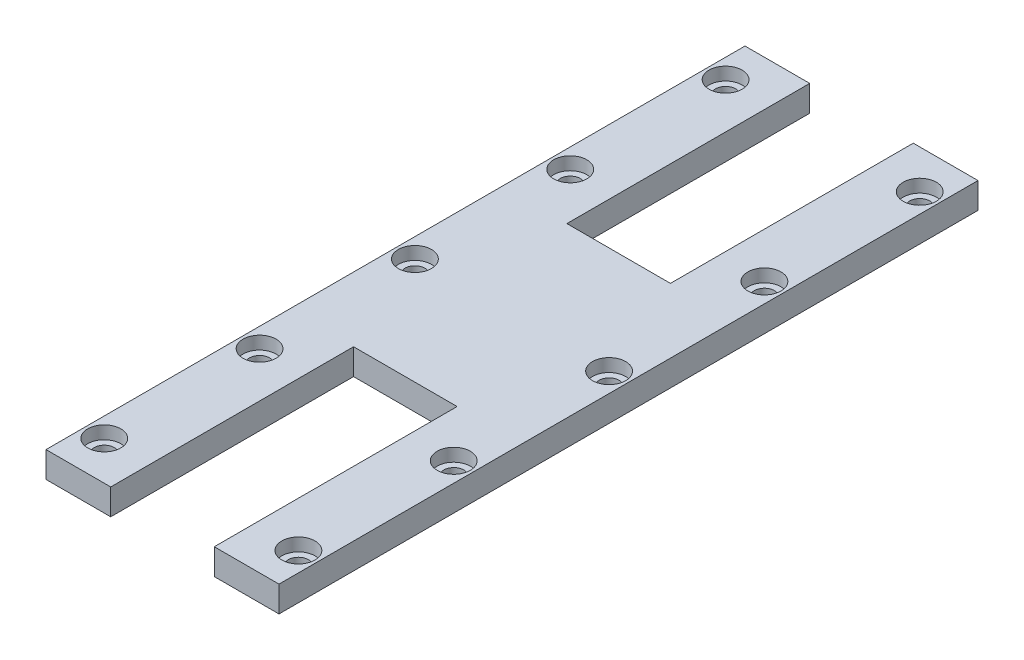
ISO-10303-21;
HEADER;
FILE_DESCRIPTION(('STEP AP214'),'2;1');
FILE_NAME('part.step','',(''),(''),'','','');
FILE_SCHEMA(('AUTOMOTIVE_DESIGN { 1 0 10303 214 1 1 1 1 }'));
ENDSEC;
DATA;
#1=APPLICATION_CONTEXT('core data for automotive mechanical design processes');
#2=APPLICATION_PROTOCOL_DEFINITION('international standard','automotive_design',2000,#1);
#3=PRODUCT_CONTEXT('',#1,'mechanical');
#4=PRODUCT('Part','Part','',(#3));
#5=PRODUCT_RELATED_PRODUCT_CATEGORY('part','',(#4));
#6=PRODUCT_DEFINITION_FORMATION('','',#4);
#7=PRODUCT_DEFINITION_CONTEXT('part definition',#1,'design');
#8=PRODUCT_DEFINITION('design','',#6,#7);
#9=PRODUCT_DEFINITION_SHAPE('','',#8);
#10=(LENGTH_UNIT() NAMED_UNIT(*) SI_UNIT(.MILLI.,.METRE.));
#11=(NAMED_UNIT(*) PLANE_ANGLE_UNIT() SI_UNIT($,.RADIAN.));
#12=(NAMED_UNIT(*) SI_UNIT($,.STERADIAN.) SOLID_ANGLE_UNIT());
#13=UNCERTAINTY_MEASURE_WITH_UNIT(LENGTH_MEASURE(1.E-05),#10,'distance_accuracy_value','');
#14=(GEOMETRIC_REPRESENTATION_CONTEXT(3) GLOBAL_UNCERTAINTY_ASSIGNED_CONTEXT((#13)) GLOBAL_UNIT_ASSIGNED_CONTEXT((#10,
#11,#12)) REPRESENTATION_CONTEXT('',''));
#15=CARTESIAN_POINT('',(0.,0.,0.));
#16=DIRECTION('',(0.,0.,1.));
#17=DIRECTION('',(1.,0.,0.));
#18=AXIS2_PLACEMENT_3D('',#15,#16,#17);
#19=CARTESIAN_POINT('',(52.3875,0.,-123.825));
#20=DIRECTION('',(0.,1.,0.));
#21=DIRECTION('',(0.,0.,1.));
#22=AXIS2_PLACEMENT_3D('',#19,#20,#21);
#23=CYLINDRICAL_SURFACE('',#22,2.45745);
#24=CARTESIAN_POINT('',(52.3875,0.,-123.825));
#25=DIRECTION('',(0.,1.,0.));
#26=DIRECTION('',(0.,0.,1.));
#27=AXIS2_PLACEMENT_3D('',#24,#25,#26);
#28=CIRCLE('',#27,2.45745);
#29=CARTESIAN_POINT('',(52.3875,0.,-121.36755));
#30=VERTEX_POINT('',#29);
#31=EDGE_CURVE('E229',#30,#30,#28,.T.);
#32=ORIENTED_EDGE('',*,*,#31,.F.);
#33=EDGE_LOOP('',(#32));
#34=FACE_BOUND('',#33,.T.);
#35=CARTESIAN_POINT('',(52.3875,3.175,-123.825));
#36=DIRECTION('',(0.,1.,0.));
#37=DIRECTION('',(0.,0.,1.));
#38=AXIS2_PLACEMENT_3D('',#35,#36,#37);
#39=CIRCLE('',#38,2.45745);
#40=CARTESIAN_POINT('',(52.3875,3.175,-121.36755));
#41=VERTEX_POINT('',#40);
#42=EDGE_CURVE('E37',#41,#41,#39,.F.);
#43=ORIENTED_EDGE('',*,*,#42,.F.);
#44=EDGE_LOOP('',(#43));
#45=FACE_BOUND('',#44,.T.);
#46=ADVANCED_FACE('F33',(#34,#45),#23,.F.);
#47=CARTESIAN_POINT('',(4.7625,0.,-47.625));
#48=DIRECTION('',(0.,1.,0.));
#49=DIRECTION('',(0.,0.,1.));
#50=AXIS2_PLACEMENT_3D('',#47,#48,#49);
#51=CYLINDRICAL_SURFACE('',#50,2.45745);
#52=CARTESIAN_POINT('',(4.7625,0.,-47.625));
#53=DIRECTION('',(0.,1.,0.));
#54=DIRECTION('',(0.,0.,1.));
#55=AXIS2_PLACEMENT_3D('',#52,#53,#54);
#56=CIRCLE('',#55,2.45745);
#57=CARTESIAN_POINT('',(4.7625,0.,-45.16755));
#58=VERTEX_POINT('',#57);
#59=EDGE_CURVE('E232',#58,#58,#56,.T.);
#60=ORIENTED_EDGE('',*,*,#59,.F.);
#61=EDGE_LOOP('',(#60));
#62=FACE_BOUND('',#61,.T.);
#63=CARTESIAN_POINT('',(4.7625,3.175,-47.625));
#64=DIRECTION('',(0.,1.,0.));
#65=DIRECTION('',(0.,0.,1.));
#66=AXIS2_PLACEMENT_3D('',#63,#64,#65);
#67=CIRCLE('',#66,2.45745);
#68=CARTESIAN_POINT('',(4.7625,3.175,-45.16755));
#69=VERTEX_POINT('',#68);
#70=EDGE_CURVE('E201',#69,#69,#67,.F.);
#71=ORIENTED_EDGE('',*,*,#70,.F.);
#72=EDGE_LOOP('',(#71));
#73=FACE_BOUND('',#72,.T.);
#74=ADVANCED_FACE('F315',(#62,#73),#51,.F.);
#75=CARTESIAN_POINT('',(4.7625,0.,-85.725));
#76=DIRECTION('',(0.,1.,0.));
#77=DIRECTION('',(0.,0.,1.));
#78=AXIS2_PLACEMENT_3D('',#75,#76,#77);
#79=CYLINDRICAL_SURFACE('',#78,2.45745);
#80=CARTESIAN_POINT('',(4.7625,0.,-85.725));
#81=DIRECTION('',(0.,1.,0.));
#82=DIRECTION('',(0.,0.,1.));
#83=AXIS2_PLACEMENT_3D('',#80,#81,#82);
#84=CIRCLE('',#83,2.45745);
#85=CARTESIAN_POINT('',(4.7625,0.,-83.26755));
#86=VERTEX_POINT('',#85);
#87=EDGE_CURVE('E235',#86,#86,#84,.T.);
#88=ORIENTED_EDGE('',*,*,#87,.F.);
#89=EDGE_LOOP('',(#88));
#90=FACE_BOUND('',#89,.T.);
#91=CARTESIAN_POINT('',(4.7625,3.175,-85.725));
#92=DIRECTION('',(0.,1.,0.));
#93=DIRECTION('',(0.,0.,1.));
#94=AXIS2_PLACEMENT_3D('',#91,#92,#93);
#95=CIRCLE('',#94,2.45745);
#96=CARTESIAN_POINT('',(4.7625,3.175,-83.26755));
#97=VERTEX_POINT('',#96);
#98=EDGE_CURVE('E199',#97,#97,#95,.F.);
#99=ORIENTED_EDGE('',*,*,#98,.F.);
#100=EDGE_LOOP('',(#99));
#101=FACE_BOUND('',#100,.T.);
#102=ADVANCED_FACE('F321',(#90,#101),#79,.F.);
#103=CARTESIAN_POINT('',(4.7625,0.,-123.825));
#104=DIRECTION('',(0.,1.,0.));
#105=DIRECTION('',(0.,0.,1.));
#106=AXIS2_PLACEMENT_3D('',#103,#104,#105);
#107=CYLINDRICAL_SURFACE('',#106,2.45745);
#108=CARTESIAN_POINT('',(4.7625,0.,-123.825));
#109=DIRECTION('',(0.,1.,0.));
#110=DIRECTION('',(0.,0.,1.));
#111=AXIS2_PLACEMENT_3D('',#108,#109,#110);
#112=CIRCLE('',#111,2.45745);
#113=CARTESIAN_POINT('',(4.7625,0.,-121.36755));
#114=VERTEX_POINT('',#113);
#115=EDGE_CURVE('E238',#114,#114,#112,.T.);
#116=ORIENTED_EDGE('',*,*,#115,.F.);
#117=EDGE_LOOP('',(#116));
#118=FACE_BOUND('',#117,.T.);
#119=CARTESIAN_POINT('',(4.7625,3.175,-123.825));
#120=DIRECTION('',(0.,1.,0.));
#121=DIRECTION('',(0.,0.,1.));
#122=AXIS2_PLACEMENT_3D('',#119,#120,#121);
#123=CIRCLE('',#122,2.45745);
#124=CARTESIAN_POINT('',(4.7625,3.175,-121.36755));
#125=VERTEX_POINT('',#124);
#126=EDGE_CURVE('E196',#125,#125,#123,.F.);
#127=ORIENTED_EDGE('',*,*,#126,.F.);
#128=EDGE_LOOP('',(#127));
#129=FACE_BOUND('',#128,.T.);
#130=ADVANCED_FACE('F328',(#118,#129),#107,.F.);
#131=CARTESIAN_POINT('',(52.3875,0.,-9.52499999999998));
#132=DIRECTION('',(0.,1.,0.));
#133=DIRECTION('',(0.,0.,1.));
#134=AXIS2_PLACEMENT_3D('',#131,#132,#133);
#135=CYLINDRICAL_SURFACE('',#134,2.45745);
#136=CARTESIAN_POINT('',(52.3875,0.,-9.52499999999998));
#137=DIRECTION('',(0.,1.,0.));
#138=DIRECTION('',(0.,0.,1.));
#139=AXIS2_PLACEMENT_3D('',#136,#137,#138);
#140=CIRCLE('',#139,2.45745);
#141=CARTESIAN_POINT('',(52.3875,0.,-7.06754999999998));
#142=VERTEX_POINT('',#141);
#143=EDGE_CURVE('E220',#142,#142,#140,.T.);
#144=ORIENTED_EDGE('',*,*,#143,.F.);
#145=EDGE_LOOP('',(#144));
#146=FACE_BOUND('',#145,.T.);
#147=CARTESIAN_POINT('',(52.3875,3.175,-9.52499999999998));
#148=DIRECTION('',(0.,1.,0.));
#149=DIRECTION('',(0.,0.,1.));
#150=AXIS2_PLACEMENT_3D('',#147,#148,#149);
#151=CIRCLE('',#150,2.45745);
#152=CARTESIAN_POINT('',(52.3875,3.175,-7.06754999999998));
#153=VERTEX_POINT('',#152);
#154=EDGE_CURVE('E193',#153,#153,#151,.F.);
#155=ORIENTED_EDGE('',*,*,#154,.F.);
#156=EDGE_LOOP('',(#155));
#157=FACE_BOUND('',#156,.T.);
#158=ADVANCED_FACE('F331',(#146,#157),#135,.F.);
#159=CARTESIAN_POINT('',(4.7625,0.,-9.52499999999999));
#160=DIRECTION('',(0.,1.,0.));
#161=DIRECTION('',(0.,0.,1.));
#162=AXIS2_PLACEMENT_3D('',#159,#160,#161);
#163=CYLINDRICAL_SURFACE('',#162,2.45745);
#164=CARTESIAN_POINT('',(4.7625,0.,-9.52499999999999));
#165=DIRECTION('',(0.,1.,0.));
#166=DIRECTION('',(0.,0.,1.));
#167=AXIS2_PLACEMENT_3D('',#164,#165,#166);
#168=CIRCLE('',#167,2.45745);
#169=CARTESIAN_POINT('',(4.7625,0.,-7.06754999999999));
#170=VERTEX_POINT('',#169);
#171=EDGE_CURVE('E217',#170,#170,#168,.T.);
#172=ORIENTED_EDGE('',*,*,#171,.F.);
#173=EDGE_LOOP('',(#172));
#174=FACE_BOUND('',#173,.T.);
#175=CARTESIAN_POINT('',(4.7625,3.175,-9.52499999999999));
#176=DIRECTION('',(0.,1.,0.));
#177=DIRECTION('',(0.,0.,1.));
#178=AXIS2_PLACEMENT_3D('',#175,#176,#177);
#179=CIRCLE('',#178,2.45745);
#180=CARTESIAN_POINT('',(4.7625,3.175,-7.06754999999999));
#181=VERTEX_POINT('',#180);
#182=EDGE_CURVE('E190',#181,#181,#179,.F.);
#183=ORIENTED_EDGE('',*,*,#182,.F.);
#184=EDGE_LOOP('',(#183));
#185=FACE_BOUND('',#184,.T.);
#186=ADVANCED_FACE('F366',(#174,#185),#163,.F.);
#187=CARTESIAN_POINT('',(52.3875,0.,-161.925));
#188=DIRECTION('',(0.,1.,0.));
#189=DIRECTION('',(0.,0.,1.));
#190=AXIS2_PLACEMENT_3D('',#187,#188,#189);
#191=CYLINDRICAL_SURFACE('',#190,2.45745);
#192=CARTESIAN_POINT('',(52.3875,0.,-161.925));
#193=DIRECTION('',(0.,1.,0.));
#194=DIRECTION('',(0.,0.,1.));
#195=AXIS2_PLACEMENT_3D('',#192,#193,#194);
#196=CIRCLE('',#195,2.45745);
#197=CARTESIAN_POINT('',(52.3875,0.,-159.46755));
#198=VERTEX_POINT('',#197);
#199=EDGE_CURVE('E178',#198,#198,#196,.T.);
#200=ORIENTED_EDGE('',*,*,#199,.F.);
#201=EDGE_LOOP('',(#200));
#202=FACE_BOUND('',#201,.T.);
#203=CARTESIAN_POINT('',(52.3875,3.175,-161.925));
#204=DIRECTION('',(0.,1.,0.));
#205=DIRECTION('',(0.,0.,1.));
#206=AXIS2_PLACEMENT_3D('',#203,#204,#205);
#207=CIRCLE('',#206,2.45745);
#208=CARTESIAN_POINT('',(52.3875,3.175,-159.46755));
#209=VERTEX_POINT('',#208);
#210=EDGE_CURVE('E187',#209,#209,#207,.F.);
#211=ORIENTED_EDGE('',*,*,#210,.F.);
#212=EDGE_LOOP('',(#211));
#213=FACE_BOUND('',#212,.T.);
#214=ADVANCED_FACE('F369',(#202,#213),#191,.F.);
#215=CARTESIAN_POINT('',(52.3875,0.,-47.625));
#216=DIRECTION('',(0.,1.,0.));
#217=DIRECTION('',(0.,0.,1.));
#218=AXIS2_PLACEMENT_3D('',#215,#216,#217);
#219=CYLINDRICAL_SURFACE('',#218,2.45745);
#220=CARTESIAN_POINT('',(52.3875,0.,-47.625));
#221=DIRECTION('',(0.,1.,0.));
#222=DIRECTION('',(0.,0.,1.));
#223=AXIS2_PLACEMENT_3D('',#220,#221,#222);
#224=CIRCLE('',#223,2.45745);
#225=CARTESIAN_POINT('',(52.3875,0.,-45.16755));
#226=VERTEX_POINT('',#225);
#227=EDGE_CURVE('E225',#226,#226,#224,.T.);
#228=ORIENTED_EDGE('',*,*,#227,.F.);
#229=EDGE_LOOP('',(#228));
#230=FACE_BOUND('',#229,.T.);
#231=CARTESIAN_POINT('',(52.3875,3.175,-47.625));
#232=DIRECTION('',(0.,1.,0.));
#233=DIRECTION('',(0.,0.,1.));
#234=AXIS2_PLACEMENT_3D('',#231,#232,#233);
#235=CIRCLE('',#234,2.45745);
#236=CARTESIAN_POINT('',(52.3875,3.175,-45.16755));
#237=VERTEX_POINT('',#236);
#238=EDGE_CURVE('E183',#237,#237,#235,.F.);
#239=ORIENTED_EDGE('',*,*,#238,.F.);
#240=EDGE_LOOP('',(#239));
#241=FACE_BOUND('',#240,.T.);
#242=ADVANCED_FACE('F345',(#230,#241),#219,.F.);
#243=CARTESIAN_POINT('',(52.3875,0.,-85.725));
#244=DIRECTION('',(0.,1.,0.));
#245=DIRECTION('',(0.,0.,1.));
#246=AXIS2_PLACEMENT_3D('',#243,#244,#245);
#247=CYLINDRICAL_SURFACE('',#246,2.45745);
#248=CARTESIAN_POINT('',(52.3875,0.,-85.725));
#249=DIRECTION('',(0.,1.,0.));
#250=DIRECTION('',(0.,0.,1.));
#251=AXIS2_PLACEMENT_3D('',#248,#249,#250);
#252=CIRCLE('',#251,2.45745);
#253=CARTESIAN_POINT('',(52.3875,0.,-83.26755));
#254=VERTEX_POINT('',#253);
#255=EDGE_CURVE('E226',#254,#254,#252,.T.);
#256=ORIENTED_EDGE('',*,*,#255,.F.);
#257=EDGE_LOOP('',(#256));
#258=FACE_BOUND('',#257,.T.);
#259=CARTESIAN_POINT('',(52.3875,3.175,-85.725));
#260=DIRECTION('',(0.,1.,0.));
#261=DIRECTION('',(0.,0.,1.));
#262=AXIS2_PLACEMENT_3D('',#259,#260,#261);
#263=CIRCLE('',#262,2.45745);
#264=CARTESIAN_POINT('',(52.3875,3.175,-83.26755));
#265=VERTEX_POINT('',#264);
#266=EDGE_CURVE('E180',#265,#265,#263,.F.);
#267=ORIENTED_EDGE('',*,*,#266,.F.);
#268=EDGE_LOOP('',(#267));
#269=FACE_BOUND('',#268,.T.);
#270=ADVANCED_FACE('F337',(#258,#269),#247,.F.);
#271=CARTESIAN_POINT('',(4.7625,0.,-161.925));
#272=DIRECTION('',(0.,1.,0.));
#273=DIRECTION('',(0.,0.,1.));
#274=AXIS2_PLACEMENT_3D('',#271,#272,#273);
#275=CYLINDRICAL_SURFACE('',#274,2.45745);
#276=CARTESIAN_POINT('',(4.7625,0.,-161.925));
#277=DIRECTION('',(0.,1.,0.));
#278=DIRECTION('',(0.,0.,1.));
#279=AXIS2_PLACEMENT_3D('',#276,#277,#278);
#280=CIRCLE('',#279,2.45745);
#281=CARTESIAN_POINT('',(4.7625,0.,-159.46755));
#282=VERTEX_POINT('',#281);
#283=EDGE_CURVE('E134',#282,#282,#280,.T.);
#284=ORIENTED_EDGE('',*,*,#283,.F.);
#285=EDGE_LOOP('',(#284));
#286=FACE_BOUND('',#285,.T.);
#287=CARTESIAN_POINT('',(4.7625,3.175,-161.925));
#288=DIRECTION('',(0.,1.,0.));
#289=DIRECTION('',(0.,0.,1.));
#290=AXIS2_PLACEMENT_3D('',#287,#288,#289);
#291=CIRCLE('',#290,2.45745);
#292=CARTESIAN_POINT('',(4.7625,3.175,-159.46755));
#293=VERTEX_POINT('',#292);
#294=EDGE_CURVE('E175',#293,#293,#291,.F.);
#295=ORIENTED_EDGE('',*,*,#294,.F.);
#296=EDGE_LOOP('',(#295));
#297=FACE_BOUND('',#296,.T.);
#298=ADVANCED_FACE('F335',(#286,#297),#275,.F.);
#299=CARTESIAN_POINT('',(0.,0.,0.));
#300=DIRECTION('',(0.,0.,-1.));
#301=DIRECTION('',(-1.,0.,0.));
#302=AXIS2_PLACEMENT_3D('',#299,#300,#301);
#303=PLANE('',#302);
#304=DIRECTION('',(1.,0.,0.));
#305=VECTOR('',#304,1.);
#306=CARTESIAN_POINT('',(0.,0.,0.));
#307=LINE('',#306,#305);
#308=CARTESIAN_POINT('',(0.,0.,0.));
#309=VERTEX_POINT('',#308);
#310=CARTESIAN_POINT('',(15.875,0.,0.));
#311=VERTEX_POINT('',#310);
#312=EDGE_CURVE('E143',#309,#311,#307,.T.);
#313=ORIENTED_EDGE('',*,*,#312,.T.);
#314=DIRECTION('',(0.,1.,0.));
#315=VECTOR('',#314,1.);
#316=CARTESIAN_POINT('',(15.875,0.,0.));
#317=LINE('',#316,#315);
#318=CARTESIAN_POINT('',(15.875,6.35,0.));
#319=VERTEX_POINT('',#318);
#320=EDGE_CURVE('E42',#311,#319,#317,.T.);
#321=ORIENTED_EDGE('',*,*,#320,.T.);
#322=DIRECTION('',(-1.,0.,0.));
#323=VECTOR('',#322,1.);
#324=CARTESIAN_POINT('',(0.,6.35,0.));
#325=LINE('',#324,#323);
#326=CARTESIAN_POINT('',(0.,6.35,0.));
#327=VERTEX_POINT('',#326);
#328=EDGE_CURVE('E140',#319,#327,#325,.T.);
#329=ORIENTED_EDGE('',*,*,#328,.T.);
#330=DIRECTION('',(0.,-1.,0.));
#331=VECTOR('',#330,1.);
#332=CARTESIAN_POINT('',(0.,0.,0.));
#333=LINE('',#332,#331);
#334=EDGE_CURVE('E270',#327,#309,#333,.T.);
#335=ORIENTED_EDGE('',*,*,#334,.T.);
#336=EDGE_LOOP('',(#313,#321,#329,#335));
#337=FACE_BOUND('',#336,.T.);
#338=ADVANCED_FACE('F138',(#337),#303,.F.);
#339=CARTESIAN_POINT('',(0.,0.,-171.45));
#340=DIRECTION('',(0.,0.,-1.));
#341=DIRECTION('',(-1.,0.,0.));
#342=AXIS2_PLACEMENT_3D('',#339,#340,#341);
#343=PLANE('',#342);
#344=DIRECTION('',(0.,1.,0.));
#345=VECTOR('',#344,1.);
#346=CARTESIAN_POINT('',(15.875,0.,-171.45));
#347=LINE('',#346,#345);
#348=CARTESIAN_POINT('',(15.875,0.,-171.45));
#349=VERTEX_POINT('',#348);
#350=CARTESIAN_POINT('',(15.875,6.35,-171.45));
#351=VERTEX_POINT('',#350);
#352=EDGE_CURVE('E170',#349,#351,#347,.T.);
#353=ORIENTED_EDGE('',*,*,#352,.F.);
#354=DIRECTION('',(1.,0.,0.));
#355=VECTOR('',#354,1.);
#356=CARTESIAN_POINT('',(0.,0.,-171.45));
#357=LINE('',#356,#355);
#358=CARTESIAN_POINT('',(0.,0.,-171.45));
#359=VERTEX_POINT('',#358);
#360=EDGE_CURVE('E274',#359,#349,#357,.T.);
#361=ORIENTED_EDGE('',*,*,#360,.F.);
#362=DIRECTION('',(0.,-1.,0.));
#363=VECTOR('',#362,1.);
#364=CARTESIAN_POINT('',(0.,0.,-171.45));
#365=LINE('',#364,#363);
#366=CARTESIAN_POINT('',(0.,6.35,-171.45));
#367=VERTEX_POINT('',#366);
#368=EDGE_CURVE('E154',#367,#359,#365,.T.);
#369=ORIENTED_EDGE('',*,*,#368,.F.);
#370=DIRECTION('',(-1.,0.,0.));
#371=VECTOR('',#370,1.);
#372=CARTESIAN_POINT('',(0.,6.35,-171.45));
#373=LINE('',#372,#371);
#374=EDGE_CURVE('E280',#351,#367,#373,.T.);
#375=ORIENTED_EDGE('',*,*,#374,.F.);
#376=EDGE_LOOP('',(#353,#361,#369,#375));
#377=FACE_BOUND('',#376,.T.);
#378=ADVANCED_FACE('F343',(#377),#343,.T.);
#379=CARTESIAN_POINT('',(0.,0.,-171.45));
#380=DIRECTION('',(-1.,0.,0.));
#381=DIRECTION('',(0.,0.,1.));
#382=AXIS2_PLACEMENT_3D('',#379,#380,#381);
#383=PLANE('',#382);
#384=ORIENTED_EDGE('',*,*,#334,.F.);
#385=DIRECTION('',(0.,0.,1.));
#386=VECTOR('',#385,1.);
#387=CARTESIAN_POINT('',(0.,6.35,-171.45));
#388=LINE('',#387,#386);
#389=EDGE_CURVE('E148',#367,#327,#388,.T.);
#390=ORIENTED_EDGE('',*,*,#389,.F.);
#391=ORIENTED_EDGE('',*,*,#368,.T.);
#392=DIRECTION('',(0.,0.,1.));
#393=VECTOR('',#392,1.);
#394=CARTESIAN_POINT('',(0.,0.,-171.45));
#395=LINE('',#394,#393);
#396=EDGE_CURVE('E166',#359,#309,#395,.T.);
#397=ORIENTED_EDGE('',*,*,#396,.T.);
#398=EDGE_LOOP('',(#384,#390,#391,#397));
#399=FACE_BOUND('',#398,.T.);
#400=ADVANCED_FACE('F35',(#399),#383,.T.);
#401=CARTESIAN_POINT('',(0.,6.35,-171.45));
#402=DIRECTION('',(0.,1.,0.));
#403=DIRECTION('',(0.,0.,1.));
#404=AXIS2_PLACEMENT_3D('',#401,#402,#403);
#405=PLANE('',#404);
#406=CARTESIAN_POINT('',(52.3875,6.35,-47.625));
#407=DIRECTION('',(0.,1.,0.));
#408=DIRECTION('',(0.,0.,1.));
#409=AXIS2_PLACEMENT_3D('',#406,#407,#408);
#410=CIRCLE('',#409,4.064);
#411=CARTESIAN_POINT('',(52.3875,6.35,-43.561));
#412=VERTEX_POINT('',#411);
#413=EDGE_CURVE('E478',#412,#412,#410,.T.);
#414=ORIENTED_EDGE('',*,*,#413,.F.);
#415=EDGE_LOOP('',(#414));
#416=FACE_BOUND('',#415,.T.);
#417=CARTESIAN_POINT('',(52.3875,6.35,-85.725));
#418=DIRECTION('',(0.,1.,0.));
#419=DIRECTION('',(0.,0.,1.));
#420=AXIS2_PLACEMENT_3D('',#417,#418,#419);
#421=CIRCLE('',#420,4.064);
#422=CARTESIAN_POINT('',(52.3875,6.35,-81.661));
#423=VERTEX_POINT('',#422);
#424=EDGE_CURVE('E471',#423,#423,#421,.T.);
#425=ORIENTED_EDGE('',*,*,#424,.F.);
#426=EDGE_LOOP('',(#425));
#427=FACE_BOUND('',#426,.T.);
#428=CARTESIAN_POINT('',(4.7625,6.35,-9.52499999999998));
#429=DIRECTION('',(0.,1.,0.));
#430=DIRECTION('',(0.,0.,1.));
#431=AXIS2_PLACEMENT_3D('',#428,#429,#430);
#432=CIRCLE('',#431,4.064);
#433=CARTESIAN_POINT('',(4.7625,6.35,-5.46099999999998));
#434=VERTEX_POINT('',#433);
#435=EDGE_CURVE('E488',#434,#434,#432,.T.);
#436=ORIENTED_EDGE('',*,*,#435,.F.);
#437=EDGE_LOOP('',(#436));
#438=FACE_BOUND('',#437,.T.);
#439=CARTESIAN_POINT('',(52.3875,6.35,-161.925));
#440=DIRECTION('',(0.,1.,0.));
#441=DIRECTION('',(0.,0.,1.));
#442=AXIS2_PLACEMENT_3D('',#439,#440,#441);
#443=CIRCLE('',#442,4.064);
#444=CARTESIAN_POINT('',(52.3875,6.35,-157.861));
#445=VERTEX_POINT('',#444);
#446=EDGE_CURVE('E494',#445,#445,#443,.T.);
#447=ORIENTED_EDGE('',*,*,#446,.F.);
#448=EDGE_LOOP('',(#447));
#449=FACE_BOUND('',#448,.T.);
#450=CARTESIAN_POINT('',(52.3875,6.35,-123.825));
#451=DIRECTION('',(0.,1.,0.));
#452=DIRECTION('',(0.,0.,1.));
#453=AXIS2_PLACEMENT_3D('',#450,#451,#452);
#454=CIRCLE('',#453,4.064);
#455=CARTESIAN_POINT('',(52.3875,6.35,-119.761));
#456=VERTEX_POINT('',#455);
#457=EDGE_CURVE('E482',#456,#456,#454,.T.);
#458=ORIENTED_EDGE('',*,*,#457,.F.);
#459=EDGE_LOOP('',(#458));
#460=FACE_BOUND('',#459,.T.);
#461=CARTESIAN_POINT('',(52.3875,6.35,-9.52499999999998));
#462=DIRECTION('',(0.,1.,0.));
#463=DIRECTION('',(0.,0.,1.));
#464=AXIS2_PLACEMENT_3D('',#461,#462,#463);
#465=CIRCLE('',#464,4.064);
#466=CARTESIAN_POINT('',(52.3875,6.35,-5.46099999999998));
#467=VERTEX_POINT('',#466);
#468=EDGE_CURVE('E450',#467,#467,#465,.T.);
#469=ORIENTED_EDGE('',*,*,#468,.F.);
#470=EDGE_LOOP('',(#469));
#471=FACE_BOUND('',#470,.T.);
#472=CARTESIAN_POINT('',(4.7625,6.35,-47.625));
#473=DIRECTION('',(0.,1.,0.));
#474=DIRECTION('',(0.,0.,1.));
#475=AXIS2_PLACEMENT_3D('',#472,#473,#474);
#476=CIRCLE('',#475,4.064);
#477=CARTESIAN_POINT('',(4.7625,6.35,-43.561));
#478=VERTEX_POINT('',#477);
#479=EDGE_CURVE('E449',#478,#478,#476,.T.);
#480=ORIENTED_EDGE('',*,*,#479,.F.);
#481=EDGE_LOOP('',(#480));
#482=FACE_BOUND('',#481,.T.);
#483=CARTESIAN_POINT('',(4.7625,6.35,-85.725));
#484=DIRECTION('',(0.,1.,0.));
#485=DIRECTION('',(0.,0.,1.));
#486=AXIS2_PLACEMENT_3D('',#483,#484,#485);
#487=CIRCLE('',#486,4.064);
#488=CARTESIAN_POINT('',(4.7625,6.35,-81.661));
#489=VERTEX_POINT('',#488);
#490=EDGE_CURVE('E460',#489,#489,#487,.T.);
#491=ORIENTED_EDGE('',*,*,#490,.F.);
#492=EDGE_LOOP('',(#491));
#493=FACE_BOUND('',#492,.T.);
#494=CARTESIAN_POINT('',(4.7625,6.35,-123.825));
#495=DIRECTION('',(0.,1.,0.));
#496=DIRECTION('',(0.,0.,1.));
#497=AXIS2_PLACEMENT_3D('',#494,#495,#496);
#498=CIRCLE('',#497,4.064);
#499=CARTESIAN_POINT('',(4.7625,6.35,-119.761));
#500=VERTEX_POINT('',#499);
#501=EDGE_CURVE('E466',#500,#500,#498,.T.);
#502=ORIENTED_EDGE('',*,*,#501,.F.);
#503=EDGE_LOOP('',(#502));
#504=FACE_BOUND('',#503,.T.);
#505=CARTESIAN_POINT('',(4.7625,6.35,-161.925));
#506=DIRECTION('',(0.,1.,0.));
#507=DIRECTION('',(0.,0.,1.));
#508=AXIS2_PLACEMENT_3D('',#505,#506,#507);
#509=CIRCLE('',#508,4.064);
#510=CARTESIAN_POINT('',(4.7625,6.35,-157.861));
#511=VERTEX_POINT('',#510);
#512=EDGE_CURVE('E206',#511,#511,#509,.T.);
#513=ORIENTED_EDGE('',*,*,#512,.F.);
#514=EDGE_LOOP('',(#513));
#515=FACE_BOUND('',#514,.T.);
#516=DIRECTION('',(0.,0.,1.));
#517=VECTOR('',#516,1.);
#518=CARTESIAN_POINT('',(15.875,6.35,0.));
#519=LINE('',#518,#517);
#520=CARTESIAN_POINT('',(15.875,6.35,-59.563));
#521=VERTEX_POINT('',#520);
#522=EDGE_CURVE('E123',#521,#319,#519,.T.);
#523=ORIENTED_EDGE('',*,*,#522,.F.);
#524=DIRECTION('',(-1.,0.,0.));
#525=VECTOR('',#524,1.);
#526=CARTESIAN_POINT('',(15.875,6.35,-59.563));
#527=LINE('',#526,#525);
#528=CARTESIAN_POINT('',(41.275,6.35,-59.563));
#529=VERTEX_POINT('',#528);
#530=EDGE_CURVE('E247',#529,#521,#527,.T.);
#531=ORIENTED_EDGE('',*,*,#530,.F.);
#532=DIRECTION('',(0.,0.,-1.));
#533=VECTOR('',#532,1.);
#534=CARTESIAN_POINT('',(41.275,6.35,0.));
#535=LINE('',#534,#533);
#536=CARTESIAN_POINT('',(41.275,6.35,0.));
#537=VERTEX_POINT('',#536);
#538=EDGE_CURVE('E133',#537,#529,#535,.T.);
#539=ORIENTED_EDGE('',*,*,#538,.F.);
#540=CARTESIAN_POINT('',(57.15,6.35,0.));
#541=VERTEX_POINT('',#540);
#542=EDGE_CURVE('E150',#541,#537,#325,.T.);
#543=ORIENTED_EDGE('',*,*,#542,.F.);
#544=DIRECTION('',(0.,0.,1.));
#545=VECTOR('',#544,1.);
#546=CARTESIAN_POINT('',(57.15,6.35,-171.45));
#547=LINE('',#546,#545);
#548=CARTESIAN_POINT('',(57.15,6.35,-171.45));
#549=VERTEX_POINT('',#548);
#550=EDGE_CURVE('E161',#549,#541,#547,.T.);
#551=ORIENTED_EDGE('',*,*,#550,.F.);
#552=CARTESIAN_POINT('',(41.275,6.35,-171.45));
#553=VERTEX_POINT('',#552);
#554=EDGE_CURVE('E168',#549,#553,#373,.T.);
#555=ORIENTED_EDGE('',*,*,#554,.T.);
#556=DIRECTION('',(0.,0.,-1.));
#557=VECTOR('',#556,1.);
#558=CARTESIAN_POINT('',(41.275,6.35,-171.45));
#559=LINE('',#558,#557);
#560=CARTESIAN_POINT('',(41.275,6.35,-111.887));
#561=VERTEX_POINT('',#560);
#562=EDGE_CURVE('E58',#561,#553,#559,.T.);
#563=ORIENTED_EDGE('',*,*,#562,.F.);
#564=DIRECTION('',(1.,0.,0.));
#565=VECTOR('',#564,1.);
#566=CARTESIAN_POINT('',(15.875,6.35,-111.887));
#567=LINE('',#566,#565);
#568=CARTESIAN_POINT('',(15.875,6.35,-111.887));
#569=VERTEX_POINT('',#568);
#570=EDGE_CURVE('E258',#569,#561,#567,.T.);
#571=ORIENTED_EDGE('',*,*,#570,.F.);
#572=DIRECTION('',(0.,0.,1.));
#573=VECTOR('',#572,1.);
#574=CARTESIAN_POINT('',(15.875,6.35,-171.45));
#575=LINE('',#574,#573);
#576=EDGE_CURVE('E255',#351,#569,#575,.T.);
#577=ORIENTED_EDGE('',*,*,#576,.F.);
#578=ORIENTED_EDGE('',*,*,#374,.T.);
#579=ORIENTED_EDGE('',*,*,#389,.T.);
#580=ORIENTED_EDGE('',*,*,#328,.F.);
#581=EDGE_LOOP('',(#523,#531,#539,#543,#551,#555,#563,#571,#577,#578,#579,#580));
#582=FACE_BOUND('',#581,.T.);
#583=ADVANCED_FACE('F146',(#416,#427,#438,#449,#460,#471,#482,#493,#504,#515,#582),#405,.T.);
#584=CARTESIAN_POINT('',(57.15,0.,-171.45));
#585=DIRECTION('',(1.,0.,0.));
#586=DIRECTION('',(0.,0.,-1.));
#587=AXIS2_PLACEMENT_3D('',#584,#585,#586);
#588=PLANE('',#587);
#589=DIRECTION('',(0.,1.,0.));
#590=VECTOR('',#589,1.);
#591=CARTESIAN_POINT('',(57.15,0.,0.));
#592=LINE('',#591,#590);
#593=CARTESIAN_POINT('',(57.15,0.,0.));
#594=VERTEX_POINT('',#593);
#595=EDGE_CURVE('E151',#594,#541,#592,.T.);
#596=ORIENTED_EDGE('',*,*,#595,.F.);
#597=DIRECTION('',(0.,0.,1.));
#598=VECTOR('',#597,1.);
#599=CARTESIAN_POINT('',(57.15,0.,-171.45));
#600=LINE('',#599,#598);
#601=CARTESIAN_POINT('',(57.15,0.,-171.45));
#602=VERTEX_POINT('',#601);
#603=EDGE_CURVE('E163',#602,#594,#600,.T.);
#604=ORIENTED_EDGE('',*,*,#603,.F.);
#605=DIRECTION('',(0.,1.,0.));
#606=VECTOR('',#605,1.);
#607=CARTESIAN_POINT('',(57.15,0.,-171.45));
#608=LINE('',#607,#606);
#609=EDGE_CURVE('E277',#602,#549,#608,.T.);
#610=ORIENTED_EDGE('',*,*,#609,.T.);
#611=ORIENTED_EDGE('',*,*,#550,.T.);
#612=EDGE_LOOP('',(#596,#604,#610,#611));
#613=FACE_BOUND('',#612,.T.);
#614=ADVANCED_FACE('F296',(#613),#588,.T.);
#615=CARTESIAN_POINT('',(0.,0.,-171.45));
#616=DIRECTION('',(0.,-1.,0.));
#617=DIRECTION('',(0.,0.,-1.));
#618=AXIS2_PLACEMENT_3D('',#615,#616,#617);
#619=PLANE('',#618);
#620=ORIENTED_EDGE('',*,*,#255,.T.);
#621=EDGE_LOOP('',(#620));
#622=FACE_BOUND('',#621,.T.);
#623=ORIENTED_EDGE('',*,*,#227,.T.);
#624=EDGE_LOOP('',(#623));
#625=FACE_BOUND('',#624,.T.);
#626=ORIENTED_EDGE('',*,*,#199,.T.);
#627=EDGE_LOOP('',(#626));
#628=FACE_BOUND('',#627,.T.);
#629=ORIENTED_EDGE('',*,*,#171,.T.);
#630=EDGE_LOOP('',(#629));
#631=FACE_BOUND('',#630,.T.);
#632=ORIENTED_EDGE('',*,*,#143,.T.);
#633=EDGE_LOOP('',(#632));
#634=FACE_BOUND('',#633,.T.);
#635=ORIENTED_EDGE('',*,*,#115,.T.);
#636=EDGE_LOOP('',(#635));
#637=FACE_BOUND('',#636,.T.);
#638=ORIENTED_EDGE('',*,*,#87,.T.);
#639=EDGE_LOOP('',(#638));
#640=FACE_BOUND('',#639,.T.);
#641=ORIENTED_EDGE('',*,*,#59,.T.);
#642=EDGE_LOOP('',(#641));
#643=FACE_BOUND('',#642,.T.);
#644=ORIENTED_EDGE('',*,*,#31,.T.);
#645=EDGE_LOOP('',(#644));
#646=FACE_BOUND('',#645,.T.);
#647=ORIENTED_EDGE('',*,*,#283,.T.);
#648=EDGE_LOOP('',(#647));
#649=FACE_BOUND('',#648,.T.);
#650=DIRECTION('',(0.,0.,-1.));
#651=VECTOR('',#650,1.);
#652=CARTESIAN_POINT('',(15.875,0.,-171.45));
#653=LINE('',#652,#651);
#654=CARTESIAN_POINT('',(15.875,0.,-59.563));
#655=VERTEX_POINT('',#654);
#656=EDGE_CURVE('E253',#311,#655,#653,.T.);
#657=ORIENTED_EDGE('',*,*,#656,.F.);
#658=ORIENTED_EDGE('',*,*,#312,.F.);
#659=ORIENTED_EDGE('',*,*,#396,.F.);
#660=ORIENTED_EDGE('',*,*,#360,.T.);
#661=DIRECTION('',(0.,0.,-1.));
#662=VECTOR('',#661,1.);
#663=CARTESIAN_POINT('',(15.875,0.,-171.45));
#664=LINE('',#663,#662);
#665=CARTESIAN_POINT('',(15.875,0.,-111.887));
#666=VERTEX_POINT('',#665);
#667=EDGE_CURVE('E268',#666,#349,#664,.T.);
#668=ORIENTED_EDGE('',*,*,#667,.F.);
#669=DIRECTION('',(-1.,0.,0.));
#670=VECTOR('',#669,1.);
#671=CARTESIAN_POINT('',(0.,0.,-111.887));
#672=LINE('',#671,#670);
#673=CARTESIAN_POINT('',(41.275,0.,-111.887));
#674=VERTEX_POINT('',#673);
#675=EDGE_CURVE('E172',#674,#666,#672,.T.);
#676=ORIENTED_EDGE('',*,*,#675,.F.);
#677=DIRECTION('',(0.,0.,1.));
#678=VECTOR('',#677,1.);
#679=CARTESIAN_POINT('',(41.275,0.,-171.45));
#680=LINE('',#679,#678);
#681=CARTESIAN_POINT('',(41.275,0.,-171.45));
#682=VERTEX_POINT('',#681);
#683=EDGE_CURVE('E265',#682,#674,#680,.T.);
#684=ORIENTED_EDGE('',*,*,#683,.F.);
#685=EDGE_CURVE('E273',#682,#602,#357,.T.);
#686=ORIENTED_EDGE('',*,*,#685,.T.);
#687=ORIENTED_EDGE('',*,*,#603,.T.);
#688=CARTESIAN_POINT('',(41.275,0.,0.));
#689=VERTEX_POINT('',#688);
#690=EDGE_CURVE('E283',#689,#594,#307,.T.);
#691=ORIENTED_EDGE('',*,*,#690,.F.);
#692=DIRECTION('',(0.,0.,1.));
#693=VECTOR('',#692,1.);
#694=CARTESIAN_POINT('',(41.275,0.,-171.45));
#695=LINE('',#694,#693);
#696=CARTESIAN_POINT('',(41.275,0.,-59.563));
#697=VERTEX_POINT('',#696);
#698=EDGE_CURVE('E50',#697,#689,#695,.T.);
#699=ORIENTED_EDGE('',*,*,#698,.F.);
#700=DIRECTION('',(1.,0.,0.));
#701=VECTOR('',#700,1.);
#702=CARTESIAN_POINT('',(0.,0.,-59.563));
#703=LINE('',#702,#701);
#704=EDGE_CURVE('E11',#655,#697,#703,.T.);
#705=ORIENTED_EDGE('',*,*,#704,.F.);
#706=EDGE_LOOP('',(#657,#658,#659,#660,#668,#676,#684,#686,#687,#691,#699,#705));
#707=FACE_BOUND('',#706,.T.);
#708=ADVANCED_FACE('F291',(#622,#625,#628,#631,#634,#637,#640,#643,#646,#649,#707),#619,.T.);
#709=DIRECTION('',(0.,-1.,0.));
#710=VECTOR('',#709,1.);
#711=CARTESIAN_POINT('',(41.275,0.,-171.45));
#712=LINE('',#711,#710);
#713=EDGE_CURVE('E160',#553,#682,#712,.T.);
#714=ORIENTED_EDGE('',*,*,#713,.F.);
#715=ORIENTED_EDGE('',*,*,#554,.F.);
#716=ORIENTED_EDGE('',*,*,#609,.F.);
#717=ORIENTED_EDGE('',*,*,#685,.F.);
#718=EDGE_LOOP('',(#714,#715,#716,#717));
#719=FACE_BOUND('',#718,.T.);
#720=ADVANCED_FACE('F751',(#719),#343,.T.);
#721=ORIENTED_EDGE('',*,*,#542,.T.);
#722=DIRECTION('',(0.,-1.,0.));
#723=VECTOR('',#722,1.);
#724=CARTESIAN_POINT('',(41.275,0.,0.));
#725=LINE('',#724,#723);
#726=EDGE_CURVE('E144',#537,#689,#725,.T.);
#727=ORIENTED_EDGE('',*,*,#726,.T.);
#728=ORIENTED_EDGE('',*,*,#690,.T.);
#729=ORIENTED_EDGE('',*,*,#595,.T.);
#730=EDGE_LOOP('',(#721,#727,#728,#729));
#731=FACE_BOUND('',#730,.T.);
#732=ADVANCED_FACE('F286',(#731),#303,.F.);
#733=CARTESIAN_POINT('',(15.875,-120.65,-171.45));
#734=DIRECTION('',(-1.,0.,0.));
#735=DIRECTION('',(0.,0.,1.));
#736=AXIS2_PLACEMENT_3D('',#733,#734,#735);
#737=PLANE('',#736);
#738=ORIENTED_EDGE('',*,*,#667,.T.);
#739=ORIENTED_EDGE('',*,*,#352,.T.);
#740=ORIENTED_EDGE('',*,*,#576,.T.);
#741=DIRECTION('',(0.,1.,0.));
#742=VECTOR('',#741,1.);
#743=CARTESIAN_POINT('',(15.875,-120.65,-111.887));
#744=LINE('',#743,#742);
#745=EDGE_CURVE('E262',#666,#569,#744,.T.);
#746=ORIENTED_EDGE('',*,*,#745,.F.);
#747=EDGE_LOOP('',(#738,#739,#740,#746));
#748=FACE_BOUND('',#747,.T.);
#749=ADVANCED_FACE('F726',(#748),#737,.F.);
#750=CARTESIAN_POINT('',(41.275,-120.65,-171.45));
#751=DIRECTION('',(1.,0.,0.));
#752=DIRECTION('',(0.,0.,-1.));
#753=AXIS2_PLACEMENT_3D('',#750,#751,#752);
#754=PLANE('',#753);
#755=ORIENTED_EDGE('',*,*,#683,.T.);
#756=DIRECTION('',(0.,1.,0.));
#757=VECTOR('',#756,1.);
#758=CARTESIAN_POINT('',(41.275,-120.65,-111.887));
#759=LINE('',#758,#757);
#760=EDGE_CURVE('E263',#674,#561,#759,.T.);
#761=ORIENTED_EDGE('',*,*,#760,.T.);
#762=ORIENTED_EDGE('',*,*,#562,.T.);
#763=ORIENTED_EDGE('',*,*,#713,.T.);
#764=EDGE_LOOP('',(#755,#761,#762,#763));
#765=FACE_BOUND('',#764,.T.);
#766=ADVANCED_FACE('F717',(#765),#754,.F.);
#767=CARTESIAN_POINT('',(15.875,-120.65,-111.887));
#768=DIRECTION('',(0.,0.,1.));
#769=DIRECTION('',(1.,0.,0.));
#770=AXIS2_PLACEMENT_3D('',#767,#768,#769);
#771=PLANE('',#770);
#772=ORIENTED_EDGE('',*,*,#675,.T.);
#773=ORIENTED_EDGE('',*,*,#745,.T.);
#774=ORIENTED_EDGE('',*,*,#570,.T.);
#775=ORIENTED_EDGE('',*,*,#760,.F.);
#776=EDGE_LOOP('',(#772,#773,#774,#775));
#777=FACE_BOUND('',#776,.T.);
#778=ADVANCED_FACE('F311',(#777),#771,.F.);
#779=CARTESIAN_POINT('',(15.875,-120.65,0.));
#780=DIRECTION('',(-1.,0.,0.));
#781=DIRECTION('',(0.,0.,1.));
#782=AXIS2_PLACEMENT_3D('',#779,#780,#781);
#783=PLANE('',#782);
#784=ORIENTED_EDGE('',*,*,#656,.T.);
#785=DIRECTION('',(0.,1.,0.));
#786=VECTOR('',#785,1.);
#787=CARTESIAN_POINT('',(15.875,-120.65,-59.563));
#788=LINE('',#787,#786);
#789=EDGE_CURVE('E128',#655,#521,#788,.T.);
#790=ORIENTED_EDGE('',*,*,#789,.T.);
#791=ORIENTED_EDGE('',*,*,#522,.T.);
#792=ORIENTED_EDGE('',*,*,#320,.F.);
#793=EDGE_LOOP('',(#784,#790,#791,#792));
#794=FACE_BOUND('',#793,.T.);
#795=ADVANCED_FACE('F125',(#794),#783,.F.);
#796=CARTESIAN_POINT('',(15.875,-120.65,-59.563));
#797=DIRECTION('',(0.,0.,-1.));
#798=DIRECTION('',(-1.,0.,0.));
#799=AXIS2_PLACEMENT_3D('',#796,#797,#798);
#800=PLANE('',#799);
#801=ORIENTED_EDGE('',*,*,#704,.T.);
#802=DIRECTION('',(0.,1.,0.));
#803=VECTOR('',#802,1.);
#804=CARTESIAN_POINT('',(41.275,-120.65,-59.563));
#805=LINE('',#804,#803);
#806=EDGE_CURVE('E249',#697,#529,#805,.T.);
#807=ORIENTED_EDGE('',*,*,#806,.T.);
#808=ORIENTED_EDGE('',*,*,#530,.T.);
#809=ORIENTED_EDGE('',*,*,#789,.F.);
#810=EDGE_LOOP('',(#801,#807,#808,#809));
#811=FACE_BOUND('',#810,.T.);
#812=ADVANCED_FACE('F302',(#811),#800,.F.);
#813=CARTESIAN_POINT('',(41.275,-120.65,0.));
#814=DIRECTION('',(1.,0.,0.));
#815=DIRECTION('',(0.,0.,-1.));
#816=AXIS2_PLACEMENT_3D('',#813,#814,#815);
#817=PLANE('',#816);
#818=ORIENTED_EDGE('',*,*,#698,.T.);
#819=ORIENTED_EDGE('',*,*,#726,.F.);
#820=ORIENTED_EDGE('',*,*,#538,.T.);
#821=ORIENTED_EDGE('',*,*,#806,.F.);
#822=EDGE_LOOP('',(#818,#819,#820,#821));
#823=FACE_BOUND('',#822,.T.);
#824=ADVANCED_FACE('F299',(#823),#817,.F.);
#825=CARTESIAN_POINT('',(4.7625,3.175,-161.925));
#826=DIRECTION('',(0.,1.,0.));
#827=DIRECTION('',(0.,0.,1.));
#828=AXIS2_PLACEMENT_3D('',#825,#826,#827);
#829=PLANE('',#828);
#830=CARTESIAN_POINT('',(4.7625,3.175,-161.925));
#831=DIRECTION('',(0.,1.,0.));
#832=DIRECTION('',(0.,0.,1.));
#833=AXIS2_PLACEMENT_3D('',#830,#831,#832);
#834=CIRCLE('',#833,4.064);
#835=CARTESIAN_POINT('',(4.7625,3.175,-157.861));
#836=VERTEX_POINT('',#835);
#837=EDGE_CURVE('E179',#836,#836,#834,.T.);
#838=ORIENTED_EDGE('',*,*,#837,.T.);
#839=EDGE_LOOP('',(#838));
#840=FACE_BOUND('',#839,.T.);
#841=ORIENTED_EDGE('',*,*,#294,.T.);
#842=EDGE_LOOP('',(#841));
#843=FACE_BOUND('',#842,.T.);
#844=ADVANCED_FACE('F309',(#840,#843),#829,.T.);
#845=CARTESIAN_POINT('',(4.7625,3.175,-161.925));
#846=DIRECTION('',(0.,1.,0.));
#847=DIRECTION('',(0.,0.,1.));
#848=AXIS2_PLACEMENT_3D('',#845,#846,#847);
#849=CYLINDRICAL_SURFACE('',#848,4.064);
#850=ORIENTED_EDGE('',*,*,#837,.F.);
#851=EDGE_LOOP('',(#850));
#852=FACE_BOUND('',#851,.T.);
#853=ORIENTED_EDGE('',*,*,#512,.T.);
#854=EDGE_LOOP('',(#853));
#855=FACE_BOUND('',#854,.T.);
#856=ADVANCED_FACE('F353',(#852,#855),#849,.F.);
#857=CARTESIAN_POINT('',(52.3875,3.175,-85.725));
#858=DIRECTION('',(0.,1.,0.));
#859=DIRECTION('',(0.,0.,1.));
#860=AXIS2_PLACEMENT_3D('',#857,#858,#859);
#861=PLANE('',#860);
#862=CARTESIAN_POINT('',(52.3875,3.175,-85.725));
#863=DIRECTION('',(0.,1.,0.));
#864=DIRECTION('',(0.,0.,1.));
#865=AXIS2_PLACEMENT_3D('',#862,#863,#864);
#866=CIRCLE('',#865,4.064);
#867=CARTESIAN_POINT('',(52.3875,3.175,-81.661));
#868=VERTEX_POINT('',#867);
#869=EDGE_CURVE('E474',#868,#868,#866,.T.);
#870=ORIENTED_EDGE('',*,*,#869,.T.);
#871=EDGE_LOOP('',(#870));
#872=FACE_BOUND('',#871,.T.);
#873=ORIENTED_EDGE('',*,*,#266,.T.);
#874=EDGE_LOOP('',(#873));
#875=FACE_BOUND('',#874,.T.);
#876=ADVANCED_FACE('F359',(#872,#875),#861,.T.);
#877=CARTESIAN_POINT('',(52.3875,3.175,-85.725));
#878=DIRECTION('',(0.,1.,0.));
#879=DIRECTION('',(0.,0.,1.));
#880=AXIS2_PLACEMENT_3D('',#877,#878,#879);
#881=CYLINDRICAL_SURFACE('',#880,4.064);
#882=ORIENTED_EDGE('',*,*,#869,.F.);
#883=EDGE_LOOP('',(#882));
#884=FACE_BOUND('',#883,.T.);
#885=ORIENTED_EDGE('',*,*,#424,.T.);
#886=EDGE_LOOP('',(#885));
#887=FACE_BOUND('',#886,.T.);
#888=ADVANCED_FACE('F387',(#884,#887),#881,.F.);
#889=CARTESIAN_POINT('',(52.3875,3.175,-47.625));
#890=DIRECTION('',(0.,1.,0.));
#891=DIRECTION('',(0.,0.,1.));
#892=AXIS2_PLACEMENT_3D('',#889,#890,#891);
#893=PLANE('',#892);
#894=CARTESIAN_POINT('',(52.3875,3.175,-47.625));
#895=DIRECTION('',(0.,1.,0.));
#896=DIRECTION('',(0.,0.,1.));
#897=AXIS2_PLACEMENT_3D('',#894,#895,#896);
#898=CIRCLE('',#897,4.064);
#899=CARTESIAN_POINT('',(52.3875,3.175,-43.561));
#900=VERTEX_POINT('',#899);
#901=EDGE_CURVE('E456',#900,#900,#898,.T.);
#902=ORIENTED_EDGE('',*,*,#901,.T.);
#903=EDGE_LOOP('',(#902));
#904=FACE_BOUND('',#903,.T.);
#905=ORIENTED_EDGE('',*,*,#238,.T.);
#906=EDGE_LOOP('',(#905));
#907=FACE_BOUND('',#906,.T.);
#908=ADVANCED_FACE('F384',(#904,#907),#893,.T.);
#909=CARTESIAN_POINT('',(52.3875,3.175,-47.625));
#910=DIRECTION('',(0.,1.,0.));
#911=DIRECTION('',(0.,0.,1.));
#912=AXIS2_PLACEMENT_3D('',#909,#910,#911);
#913=CYLINDRICAL_SURFACE('',#912,4.064);
#914=ORIENTED_EDGE('',*,*,#901,.F.);
#915=EDGE_LOOP('',(#914));
#916=FACE_BOUND('',#915,.T.);
#917=ORIENTED_EDGE('',*,*,#413,.T.);
#918=EDGE_LOOP('',(#917));
#919=FACE_BOUND('',#918,.T.);
#920=ADVANCED_FACE('F386',(#916,#919),#913,.F.);
#921=CARTESIAN_POINT('',(52.3875,3.175,-161.925));
#922=DIRECTION('',(0.,1.,0.));
#923=DIRECTION('',(0.,0.,1.));
#924=AXIS2_PLACEMENT_3D('',#921,#922,#923);
#925=PLANE('',#924);
#926=CARTESIAN_POINT('',(52.3875,3.175,-161.925));
#927=DIRECTION('',(0.,1.,0.));
#928=DIRECTION('',(0.,0.,1.));
#929=AXIS2_PLACEMENT_3D('',#926,#927,#928);
#930=CIRCLE('',#929,4.064);
#931=CARTESIAN_POINT('',(52.3875,3.175,-157.861));
#932=VERTEX_POINT('',#931);
#933=EDGE_CURVE('E485',#932,#932,#930,.T.);
#934=ORIENTED_EDGE('',*,*,#933,.T.);
#935=EDGE_LOOP('',(#934));
#936=FACE_BOUND('',#935,.T.);
#937=ORIENTED_EDGE('',*,*,#210,.T.);
#938=EDGE_LOOP('',(#937));
#939=FACE_BOUND('',#938,.T.);
#940=ADVANCED_FACE('F394',(#936,#939),#925,.T.);
#941=CARTESIAN_POINT('',(52.3875,3.175,-161.925));
#942=DIRECTION('',(0.,1.,0.));
#943=DIRECTION('',(0.,0.,1.));
#944=AXIS2_PLACEMENT_3D('',#941,#942,#943);
#945=CYLINDRICAL_SURFACE('',#944,4.064);
#946=ORIENTED_EDGE('',*,*,#933,.F.);
#947=EDGE_LOOP('',(#946));
#948=FACE_BOUND('',#947,.T.);
#949=ORIENTED_EDGE('',*,*,#446,.T.);
#950=EDGE_LOOP('',(#949));
#951=FACE_BOUND('',#950,.T.);
#952=ADVANCED_FACE('F502',(#948,#951),#945,.F.);
#953=CARTESIAN_POINT('',(4.7625,3.175,-9.52499999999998));
#954=DIRECTION('',(0.,1.,0.));
#955=DIRECTION('',(0.,0.,1.));
#956=AXIS2_PLACEMENT_3D('',#953,#954,#955);
#957=PLANE('',#956);
#958=CARTESIAN_POINT('',(4.7625,3.175,-9.52499999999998));
#959=DIRECTION('',(0.,1.,0.));
#960=DIRECTION('',(0.,0.,1.));
#961=AXIS2_PLACEMENT_3D('',#958,#959,#960);
#962=CIRCLE('',#961,4.064);
#963=CARTESIAN_POINT('',(4.7625,3.175,-5.46099999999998));
#964=VERTEX_POINT('',#963);
#965=EDGE_CURVE('E491',#964,#964,#962,.T.);
#966=ORIENTED_EDGE('',*,*,#965,.T.);
#967=EDGE_LOOP('',(#966));
#968=FACE_BOUND('',#967,.T.);
#969=ORIENTED_EDGE('',*,*,#182,.T.);
#970=EDGE_LOOP('',(#969));
#971=FACE_BOUND('',#970,.T.);
#972=ADVANCED_FACE('F440',(#968,#971),#957,.T.);
#973=CARTESIAN_POINT('',(4.7625,3.175,-9.52499999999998));
#974=DIRECTION('',(0.,1.,0.));
#975=DIRECTION('',(0.,0.,1.));
#976=AXIS2_PLACEMENT_3D('',#973,#974,#975);
#977=CYLINDRICAL_SURFACE('',#976,4.064);
#978=ORIENTED_EDGE('',*,*,#965,.F.);
#979=EDGE_LOOP('',(#978));
#980=FACE_BOUND('',#979,.T.);
#981=ORIENTED_EDGE('',*,*,#435,.T.);
#982=EDGE_LOOP('',(#981));
#983=FACE_BOUND('',#982,.T.);
#984=ADVANCED_FACE('F433',(#980,#983),#977,.F.);
#985=CARTESIAN_POINT('',(52.3875,3.175,-9.52499999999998));
#986=DIRECTION('',(0.,1.,0.));
#987=DIRECTION('',(0.,0.,1.));
#988=AXIS2_PLACEMENT_3D('',#985,#986,#987);
#989=PLANE('',#988);
#990=CARTESIAN_POINT('',(52.3875,3.175,-9.52499999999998));
#991=DIRECTION('',(0.,1.,0.));
#992=DIRECTION('',(0.,0.,1.));
#993=AXIS2_PLACEMENT_3D('',#990,#991,#992);
#994=CIRCLE('',#993,4.064);
#995=CARTESIAN_POINT('',(52.3875,3.175,-5.46099999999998));
#996=VERTEX_POINT('',#995);
#997=EDGE_CURVE('E446',#996,#996,#994,.T.);
#998=ORIENTED_EDGE('',*,*,#997,.T.);
#999=EDGE_LOOP('',(#998));
#1000=FACE_BOUND('',#999,.T.);
#1001=ORIENTED_EDGE('',*,*,#154,.T.);
#1002=EDGE_LOOP('',(#1001));
#1003=FACE_BOUND('',#1002,.T.);
#1004=ADVANCED_FACE('F431',(#1000,#1003),#989,.T.);
#1005=CARTESIAN_POINT('',(52.3875,3.175,-9.52499999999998));
#1006=DIRECTION('',(0.,1.,0.));
#1007=DIRECTION('',(0.,0.,1.));
#1008=AXIS2_PLACEMENT_3D('',#1005,#1006,#1007);
#1009=CYLINDRICAL_SURFACE('',#1008,4.064);
#1010=ORIENTED_EDGE('',*,*,#997,.F.);
#1011=EDGE_LOOP('',(#1010));
#1012=FACE_BOUND('',#1011,.T.);
#1013=ORIENTED_EDGE('',*,*,#468,.T.);
#1014=EDGE_LOOP('',(#1013));
#1015=FACE_BOUND('',#1014,.T.);
#1016=ADVANCED_FACE('F363',(#1012,#1015),#1009,.F.);
#1017=CARTESIAN_POINT('',(4.7625,3.175,-123.825));
#1018=DIRECTION('',(0.,1.,0.));
#1019=DIRECTION('',(0.,0.,1.));
#1020=AXIS2_PLACEMENT_3D('',#1017,#1018,#1019);
#1021=PLANE('',#1020);
#1022=CARTESIAN_POINT('',(4.7625,3.175,-123.825));
#1023=DIRECTION('',(0.,1.,0.));
#1024=DIRECTION('',(0.,0.,1.));
#1025=AXIS2_PLACEMENT_3D('',#1022,#1023,#1024);
#1026=CIRCLE('',#1025,4.064);
#1027=CARTESIAN_POINT('',(4.7625,3.175,-119.761));
#1028=VERTEX_POINT('',#1027);
#1029=EDGE_CURVE('E184',#1028,#1028,#1026,.T.);
#1030=ORIENTED_EDGE('',*,*,#1029,.T.);
#1031=EDGE_LOOP('',(#1030));
#1032=FACE_BOUND('',#1031,.T.);
#1033=ORIENTED_EDGE('',*,*,#126,.T.);
#1034=EDGE_LOOP('',(#1033));
#1035=FACE_BOUND('',#1034,.T.);
#1036=ADVANCED_FACE('F407',(#1032,#1035),#1021,.T.);
#1037=CARTESIAN_POINT('',(4.7625,3.175,-123.825));
#1038=DIRECTION('',(0.,1.,0.));
#1039=DIRECTION('',(0.,0.,1.));
#1040=AXIS2_PLACEMENT_3D('',#1037,#1038,#1039);
#1041=CYLINDRICAL_SURFACE('',#1040,4.064);
#1042=ORIENTED_EDGE('',*,*,#1029,.F.);
#1043=EDGE_LOOP('',(#1042));
#1044=FACE_BOUND('',#1043,.T.);
#1045=ORIENTED_EDGE('',*,*,#501,.T.);
#1046=EDGE_LOOP('',(#1045));
#1047=FACE_BOUND('',#1046,.T.);
#1048=ADVANCED_FACE('F410',(#1044,#1047),#1041,.F.);
#1049=CARTESIAN_POINT('',(4.7625,3.175,-85.725));
#1050=DIRECTION('',(0.,1.,0.));
#1051=DIRECTION('',(0.,0.,1.));
#1052=AXIS2_PLACEMENT_3D('',#1049,#1050,#1051);
#1053=PLANE('',#1052);
#1054=CARTESIAN_POINT('',(4.7625,3.175,-85.725));
#1055=DIRECTION('',(0.,1.,0.));
#1056=DIRECTION('',(0.,0.,1.));
#1057=AXIS2_PLACEMENT_3D('',#1054,#1055,#1056);
#1058=CIRCLE('',#1057,4.064);
#1059=CARTESIAN_POINT('',(4.7625,3.175,-81.661));
#1060=VERTEX_POINT('',#1059);
#1061=EDGE_CURVE('E463',#1060,#1060,#1058,.T.);
#1062=ORIENTED_EDGE('',*,*,#1061,.T.);
#1063=EDGE_LOOP('',(#1062));
#1064=FACE_BOUND('',#1063,.T.);
#1065=ORIENTED_EDGE('',*,*,#98,.T.);
#1066=EDGE_LOOP('',(#1065));
#1067=FACE_BOUND('',#1066,.T.);
#1068=ADVANCED_FACE('F414',(#1064,#1067),#1053,.T.);
#1069=CARTESIAN_POINT('',(4.7625,3.175,-85.725));
#1070=DIRECTION('',(0.,1.,0.));
#1071=DIRECTION('',(0.,0.,1.));
#1072=AXIS2_PLACEMENT_3D('',#1069,#1070,#1071);
#1073=CYLINDRICAL_SURFACE('',#1072,4.064);
#1074=ORIENTED_EDGE('',*,*,#1061,.F.);
#1075=EDGE_LOOP('',(#1074));
#1076=FACE_BOUND('',#1075,.T.);
#1077=ORIENTED_EDGE('',*,*,#490,.T.);
#1078=EDGE_LOOP('',(#1077));
#1079=FACE_BOUND('',#1078,.T.);
#1080=ADVANCED_FACE('F418',(#1076,#1079),#1073,.F.);
#1081=CARTESIAN_POINT('',(4.7625,3.175,-47.625));
#1082=DIRECTION('',(0.,1.,0.));
#1083=DIRECTION('',(0.,0.,1.));
#1084=AXIS2_PLACEMENT_3D('',#1081,#1082,#1083);
#1085=PLANE('',#1084);
#1086=CARTESIAN_POINT('',(4.7625,3.175,-47.625));
#1087=DIRECTION('',(0.,1.,0.));
#1088=DIRECTION('',(0.,0.,1.));
#1089=AXIS2_PLACEMENT_3D('',#1086,#1087,#1088);
#1090=CIRCLE('',#1089,4.064);
#1091=CARTESIAN_POINT('',(4.7625,3.175,-43.561));
#1092=VERTEX_POINT('',#1091);
#1093=EDGE_CURVE('E453',#1092,#1092,#1090,.T.);
#1094=ORIENTED_EDGE('',*,*,#1093,.T.);
#1095=EDGE_LOOP('',(#1094));
#1096=FACE_BOUND('',#1095,.T.);
#1097=ORIENTED_EDGE('',*,*,#70,.T.);
#1098=EDGE_LOOP('',(#1097));
#1099=FACE_BOUND('',#1098,.T.);
#1100=ADVANCED_FACE('F422',(#1096,#1099),#1085,.T.);
#1101=CARTESIAN_POINT('',(4.7625,3.175,-47.625));
#1102=DIRECTION('',(0.,1.,0.));
#1103=DIRECTION('',(0.,0.,1.));
#1104=AXIS2_PLACEMENT_3D('',#1101,#1102,#1103);
#1105=CYLINDRICAL_SURFACE('',#1104,4.064);
#1106=ORIENTED_EDGE('',*,*,#1093,.F.);
#1107=EDGE_LOOP('',(#1106));
#1108=FACE_BOUND('',#1107,.T.);
#1109=ORIENTED_EDGE('',*,*,#479,.T.);
#1110=EDGE_LOOP('',(#1109));
#1111=FACE_BOUND('',#1110,.T.);
#1112=ADVANCED_FACE('F426',(#1108,#1111),#1105,.F.);
#1113=CARTESIAN_POINT('',(52.3875,3.175,-123.825));
#1114=DIRECTION('',(0.,1.,0.));
#1115=DIRECTION('',(0.,0.,1.));
#1116=AXIS2_PLACEMENT_3D('',#1113,#1114,#1115);
#1117=PLANE('',#1116);
#1118=CARTESIAN_POINT('',(52.3875,3.175,-123.825));
#1119=DIRECTION('',(0.,1.,0.));
#1120=DIRECTION('',(0.,0.,1.));
#1121=AXIS2_PLACEMENT_3D('',#1118,#1119,#1120);
#1122=CIRCLE('',#1121,4.064);
#1123=CARTESIAN_POINT('',(52.3875,3.175,-119.761));
#1124=VERTEX_POINT('',#1123);
#1125=EDGE_CURVE('E475',#1124,#1124,#1122,.T.);
#1126=ORIENTED_EDGE('',*,*,#1125,.T.);
#1127=EDGE_LOOP('',(#1126));
#1128=FACE_BOUND('',#1127,.T.);
#1129=ORIENTED_EDGE('',*,*,#42,.T.);
#1130=EDGE_LOOP('',(#1129));
#1131=FACE_BOUND('',#1130,.T.);
#1132=ADVANCED_FACE('F429',(#1128,#1131),#1117,.T.);
#1133=CARTESIAN_POINT('',(52.3875,3.175,-123.825));
#1134=DIRECTION('',(0.,1.,0.));
#1135=DIRECTION('',(0.,0.,1.));
#1136=AXIS2_PLACEMENT_3D('',#1133,#1134,#1135);
#1137=CYLINDRICAL_SURFACE('',#1136,4.064);
#1138=ORIENTED_EDGE('',*,*,#1125,.F.);
#1139=EDGE_LOOP('',(#1138));
#1140=FACE_BOUND('',#1139,.T.);
#1141=ORIENTED_EDGE('',*,*,#457,.T.);
#1142=EDGE_LOOP('',(#1141));
#1143=FACE_BOUND('',#1142,.T.);
#1144=ADVANCED_FACE('F401',(#1140,#1143),#1137,.F.);
#1145=CLOSED_SHELL('',(#46,#74,#102,#130,#158,#186,#214,#242,#270,#298,#338,#378,#400,#583,#614,
#708,#720,#732,#749,#766,#778,#795,#812,#824,#844,#856,#876,#888,#908,#920,#940,#952,#972,#984,
#1004,#1016,#1036,#1048,#1068,#1080,#1100,#1112,#1132,#1144));
#1146=MANIFOLD_SOLID_BREP('B2',#1145);
#1147=ADVANCED_BREP_SHAPE_REPRESENTATION('',(#18,#1146),#14);
#1148=SHAPE_DEFINITION_REPRESENTATION(#9,#1147);
ENDSEC;
END-ISO-10303-21;
